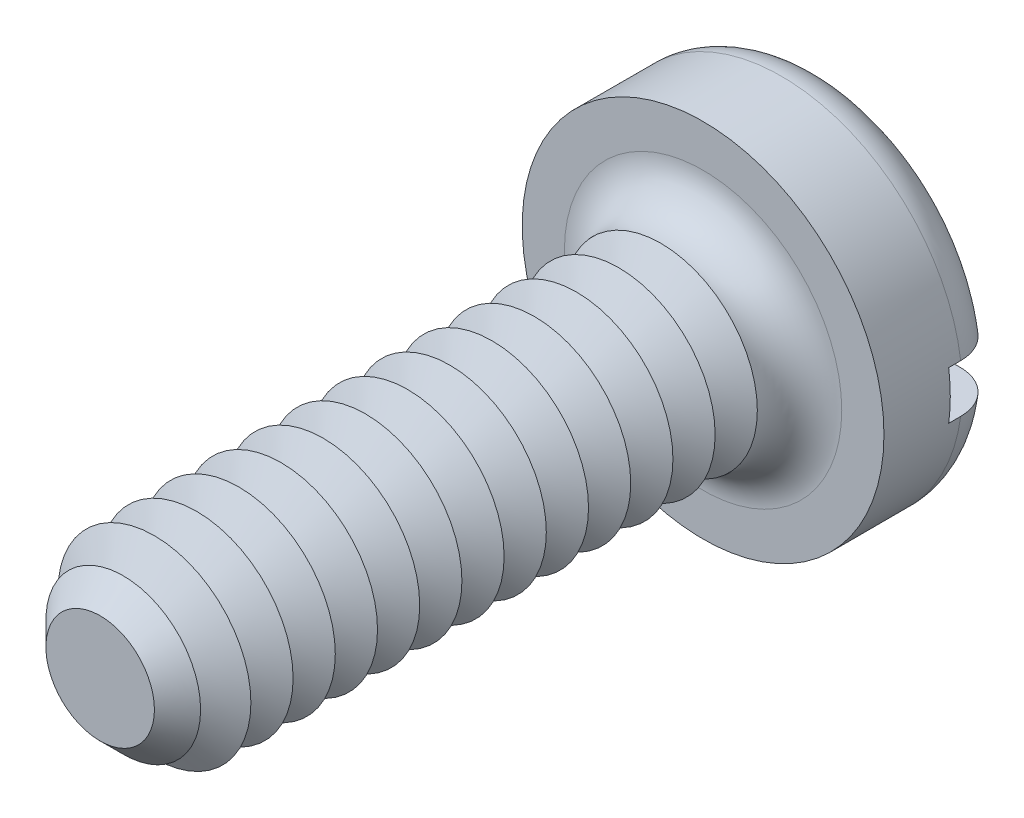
ISO-10303-21;
HEADER;
FILE_DESCRIPTION(('STEP AP214'),'2;1');
FILE_NAME('part.step','',(''),(''),'','','');
FILE_SCHEMA(('AUTOMOTIVE_DESIGN { 1 0 10303 214 1 1 1 1 }'));
ENDSEC;
DATA;
#1=APPLICATION_CONTEXT('core data for automotive mechanical design processes');
#2=APPLICATION_PROTOCOL_DEFINITION('international standard','automotive_design',2000,#1);
#3=PRODUCT_CONTEXT('',#1,'mechanical');
#4=PRODUCT('Part','Part','',(#3));
#5=PRODUCT_RELATED_PRODUCT_CATEGORY('part','',(#4));
#6=PRODUCT_DEFINITION_FORMATION('','',#4);
#7=PRODUCT_DEFINITION_CONTEXT('part definition',#1,'design');
#8=PRODUCT_DEFINITION('design','',#6,#7);
#9=PRODUCT_DEFINITION_SHAPE('','',#8);
#10=(LENGTH_UNIT() NAMED_UNIT(*) SI_UNIT(.MILLI.,.METRE.));
#11=(NAMED_UNIT(*) PLANE_ANGLE_UNIT() SI_UNIT($,.RADIAN.));
#12=(NAMED_UNIT(*) SI_UNIT($,.STERADIAN.) SOLID_ANGLE_UNIT());
#13=UNCERTAINTY_MEASURE_WITH_UNIT(LENGTH_MEASURE(1.E-05),#10,'distance_accuracy_value','');
#14=(GEOMETRIC_REPRESENTATION_CONTEXT(3) GLOBAL_UNCERTAINTY_ASSIGNED_CONTEXT((#13)) GLOBAL_UNIT_ASSIGNED_CONTEXT((#10,
#11,#12)) REPRESENTATION_CONTEXT('',''));
#15=CARTESIAN_POINT('',(0.,0.,0.));
#16=DIRECTION('',(0.,0.,1.));
#17=DIRECTION('',(1.,0.,0.));
#18=AXIS2_PLACEMENT_3D('',#15,#16,#17);
#19=CARTESIAN_POINT('',(0.,0.,-1.));
#20=DIRECTION('',(0.,0.,1.));
#21=DIRECTION('',(1.,0.,0.));
#22=AXIS2_PLACEMENT_3D('',#19,#20,#21);
#23=PLANE('',#22);
#24=CARTESIAN_POINT('',(0.,0.,-1.));
#25=DIRECTION('',(0.,0.,1.));
#26=DIRECTION('',(1.,0.,0.));
#27=AXIS2_PLACEMENT_3D('',#24,#25,#26);
#28=CIRCLE('',#27,1.15);
#29=CARTESIAN_POINT('',(-1.13247516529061,0.2,-1.));
#30=VERTEX_POINT('',#29);
#31=CARTESIAN_POINT('',(1.13247516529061,0.2,-1.));
#32=VERTEX_POINT('',#31);
#33=EDGE_CURVE('E116',#30,#32,#28,.F.);
#34=ORIENTED_EDGE('',*,*,#33,.T.);
#35=DIRECTION('',(1.,0.,0.));
#36=VECTOR('',#35,1.);
#37=CARTESIAN_POINT('',(-1.5,0.2,-1.));
#38=LINE('',#37,#36);
#39=EDGE_CURVE('E111',#30,#32,#38,.T.);
#40=ORIENTED_EDGE('',*,*,#39,.F.);
#41=EDGE_LOOP('',(#34,#40));
#42=FACE_BOUND('',#41,.T.);
#43=ADVANCED_FACE('F39',(#42),#23,.F.);
#44=CARTESIAN_POINT('',(0.,0.,-0.65));
#45=DIRECTION('',(0.,0.,1.));
#46=DIRECTION('',(1.,0.,0.));
#47=AXIS2_PLACEMENT_3D('',#44,#45,#46);
#48=TOROIDAL_SURFACE('',#47,1.15,0.35);
#49=CARTESIAN_POINT('',(-1.38697162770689,0.2,-0.89359719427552));
#50=CARTESIAN_POINT('',(-1.37305556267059,0.2,-0.907805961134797));
#51=CARTESIAN_POINT('',(-1.35791811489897,0.2,-0.9208403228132));
#52=CARTESIAN_POINT('',(-1.32565069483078,0.2,-0.944183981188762));
#53=CARTESIAN_POINT('',(-1.3085180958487,0.2,-0.954489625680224));
#54=CARTESIAN_POINT('',(-1.27278567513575,0.2,-0.972077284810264));
#55=CARTESIAN_POINT('',(-1.25418732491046,0.2,-0.979362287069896));
#56=CARTESIAN_POINT('',(-1.21604452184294,0.2,-0.990735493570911));
#57=CARTESIAN_POINT('',(-1.19650030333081,0.2,-0.994824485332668));
#58=CARTESIAN_POINT('',(-1.15682398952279,0.2,-0.99973845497));
#59=CARTESIAN_POINT('',(-1.1366881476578,0.2,-1.00053316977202));
#60=CARTESIAN_POINT('',(-1.09656272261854,0.2,-0.998770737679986));
#61=CARTESIAN_POINT('',(-1.07657315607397,0.2,-0.996213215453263));
#62=CARTESIAN_POINT('',(-1.03707277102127,0.2,-0.987780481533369));
#63=CARTESIAN_POINT('',(-1.01756977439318,0.2,-0.981868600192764));
#64=CARTESIAN_POINT('',(-0.979825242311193,0.2,-0.966867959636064));
#65=CARTESIAN_POINT('',(-0.961583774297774,0.2,-0.957779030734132));
#66=CARTESIAN_POINT('',(-0.926815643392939,0.2,-0.936628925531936));
#67=CARTESIAN_POINT('',(-0.910295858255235,0.2,-0.924556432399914));
#68=CARTESIAN_POINT('',(-0.879544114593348,0.2,-0.897781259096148));
#69=CARTESIAN_POINT('',(-0.8653120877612,0.2,-0.883078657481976));
#70=CARTESIAN_POINT('',(-0.83972745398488,0.2,-0.851619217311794));
#71=CARTESIAN_POINT('',(-0.8283448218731,0.2,-0.834886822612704));
#72=CARTESIAN_POINT('',(-0.80863848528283,0.2,-0.799707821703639));
#73=CARTESIAN_POINT('',(-0.80031425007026,0.2,-0.781261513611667));
#74=CARTESIAN_POINT('',(-0.787199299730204,0.2,-0.743695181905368));
#75=CARTESIAN_POINT('',(-0.782321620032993,0.2,-0.724605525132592));
#76=CARTESIAN_POINT('',(-0.775930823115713,0.2,-0.685871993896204));
#77=CARTESIAN_POINT('',(-0.774417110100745,0.2,-0.666228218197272));
#78=CARTESIAN_POINT('',(-0.774805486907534,0.2,-0.627456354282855));
#79=CARTESIAN_POINT('',(-0.776625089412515,0.2,-0.608327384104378));
#80=CARTESIAN_POINT('',(-0.783452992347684,0.2,-0.570648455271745));
#81=CARTESIAN_POINT('',(-0.788461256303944,0.2,-0.552098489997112));
#82=CARTESIAN_POINT('',(-0.801489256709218,0.2,-0.516098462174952));
#83=CARTESIAN_POINT('',(-0.809507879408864,0.2,-0.49864799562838));
#84=CARTESIAN_POINT('',(-0.828295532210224,0.2,-0.465297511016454));
#85=CARTESIAN_POINT('',(-0.839064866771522,0.2,-0.449397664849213));
#86=CARTESIAN_POINT('',(-0.863311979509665,0.2,-0.419196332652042));
#87=CARTESIAN_POINT('',(-0.876847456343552,0.2,-0.404941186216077));
#88=CARTESIAN_POINT('',(-0.906064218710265,0.2,-0.378832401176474));
#89=CARTESIAN_POINT('',(-0.921745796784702,0.2,-0.366979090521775));
#90=CARTESIAN_POINT('',(-0.955261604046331,0.2,-0.345690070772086));
#91=CARTESIAN_POINT('',(-0.973141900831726,0.2,-0.336326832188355));
#92=CARTESIAN_POINT('',(-1.01020647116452,0.2,-0.320690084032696));
#93=CARTESIAN_POINT('',(-1.02939085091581,0.2,-0.314416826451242));
#94=CARTESIAN_POINT('',(-1.06878849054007,0.2,-0.305073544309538));
#95=CARTESIAN_POINT('',(-1.0890118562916,0.2,-0.302046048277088));
#96=CARTESIAN_POINT('',(-1.12968032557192,0.2,-0.299436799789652));
#97=CARTESIAN_POINT('',(-1.15012542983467,0.2,-0.299855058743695));
#98=CARTESIAN_POINT('',(-1.1906059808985,0.2,-0.304138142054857));
#99=CARTESIAN_POINT('',(-1.21064224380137,0.2,-0.307995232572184));
#100=CARTESIAN_POINT('',(-1.24976957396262,0.2,-0.319055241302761));
#101=CARTESIAN_POINT('',(-1.26886068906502,0.2,-0.326257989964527));
#102=CARTESIAN_POINT('',(-1.30533597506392,0.2,-0.343725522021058));
#103=CARTESIAN_POINT('',(-1.32273620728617,0.2,-0.353956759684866));
#104=CARTESIAN_POINT('',(-1.35554323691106,0.2,-0.377229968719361));
#105=CARTESIAN_POINT('',(-1.37095016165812,0.2,-0.390271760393));
#106=CARTESIAN_POINT('',(-1.39913145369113,0.2,-0.418621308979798));
#107=CARTESIAN_POINT('',(-1.41193602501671,0.2,-0.43389904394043));
#108=CARTESIAN_POINT('',(-1.43476712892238,0.2,-0.46640589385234));
#109=CARTESIAN_POINT('',(-1.44479381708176,0.2,-0.483634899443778));
#110=CARTESIAN_POINT('',(-1.4616814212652,0.2,-0.519367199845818));
#111=CARTESIAN_POINT('',(-1.46857323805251,0.2,-0.537855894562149));
#112=CARTESIAN_POINT('',(-1.4791331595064,0.2,-0.575731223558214));
#113=CARTESIAN_POINT('',(-1.48280152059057,0.2,-0.595117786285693));
#114=CARTESIAN_POINT('',(-1.4867930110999,0.2,-0.634109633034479));
#115=CARTESIAN_POINT('',(-1.48713684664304,0.2,-0.653712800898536));
#116=CARTESIAN_POINT('',(-1.48452244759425,0.2,-0.692702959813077));
#117=CARTESIAN_POINT('',(-1.48156342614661,0.2,-0.712089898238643));
#118=CARTESIAN_POINT('',(-1.47243636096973,0.2,-0.75006822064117));
#119=CARTESIAN_POINT('',(-1.46627182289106,0.2,-0.768660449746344));
#120=CARTESIAN_POINT('',(-1.45092056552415,0.2,-0.804533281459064));
#121=CARTESIAN_POINT('',(-1.44173755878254,0.2,-0.821815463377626));
#122=CARTESIAN_POINT('',(-1.42477940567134,0.2,-0.848152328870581));
#123=CARTESIAN_POINT('',(-1.41786672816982,0.2,-0.857773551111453));
#124=CARTESIAN_POINT('',(-1.40310412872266,0.2,-0.876267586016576));
#125=CARTESIAN_POINT('',(-1.39525421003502,0.2,-0.885140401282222));
#126=CARTESIAN_POINT('',(-1.38697162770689,0.2,-0.89359719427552));
#127=B_SPLINE_CURVE_WITH_KNOTS('',3,(#49,#50,#51,#52,#53,#54,#55,#56,#57,#58,#59,#60,#61,#62,
#63,#64,#65,#66,#67,#68,#69,#70,#71,#72,#73,#74,#75,#76,#77,#78,#79,#80,#81,#82,#83,#84,#85,#86,
#87,#88,#89,#90,#91,#92,#93,#94,#95,#96,#97,#98,#99,#100,#101,#102,#103,#104,#105,#106,#107,
#108,#109,#110,#111,#112,#113,#114,#115,#116,#117,#118,#119,#120,#121,#122,#123,#124,#125,#126),
.UNSPECIFIED.,.T.,.F.,(4,2,2,2,2,2,2,2,2,2,2,2,2,2,2,2,2,2,2,2,2,2,2,2,2,2,2,2,2,2,2,2,2,2,2,2,
2,2,4),(0.,0.0596211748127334,0.119321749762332,0.178963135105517,0.238589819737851,
0.298763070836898,0.358943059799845,0.419793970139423,0.48064813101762,0.541736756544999,
0.602823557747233,0.663236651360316,0.72363925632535,0.782457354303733,0.841265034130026,
0.898637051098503,0.956008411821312,1.01335856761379,1.07071507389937,1.12941939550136,
1.18813172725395,1.24840147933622,1.30867614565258,1.36973127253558,1.43078660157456,
1.49170496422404,1.55262023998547,1.61288453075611,1.67314496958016,1.73266007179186,
1.792171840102,1.85108355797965,1.90999058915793,1.96853049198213,2.02708434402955,
2.08557429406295,2.14399257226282,2.17947810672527,2.21496351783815),.UNSPECIFIED.);
#128=CARTESIAN_POINT('',(-1.48660687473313,0.2,-0.649999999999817));
#129=VERTEX_POINT('',#128);
#130=EDGE_CURVE('E289',#129,#30,#127,.T.);
#131=ORIENTED_EDGE('',*,*,#130,.F.);
#132=CARTESIAN_POINT('',(0.,0.,-0.65));
#133=DIRECTION('',(0.,0.,1.));
#134=DIRECTION('',(1.,0.,0.));
#135=AXIS2_PLACEMENT_3D('',#132,#133,#134);
#136=CIRCLE('',#135,1.5);
#137=CARTESIAN_POINT('',(1.48660687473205,0.2,-0.649999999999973));
#138=VERTEX_POINT('',#137);
#139=EDGE_CURVE('E125',#138,#129,#136,.T.);
#140=ORIENTED_EDGE('',*,*,#139,.F.);
#141=CARTESIAN_POINT('',(0.780520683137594,0.2,-0.713112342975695));
#142=CARTESIAN_POINT('',(0.784146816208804,0.2,-0.73226748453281));
#143=CARTESIAN_POINT('',(0.789425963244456,0.2,-0.751125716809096));
#144=CARTESIAN_POINT('',(0.803106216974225,0.2,-0.78769198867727));
#145=CARTESIAN_POINT('',(0.811511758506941,0.2,-0.805398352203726));
#146=CARTESIAN_POINT('',(0.831144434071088,0.2,-0.839131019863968));
#147=CARTESIAN_POINT('',(0.842366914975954,0.2,-0.855160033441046));
#148=CARTESIAN_POINT('',(0.867288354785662,0.2,-0.88515062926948));
#149=CARTESIAN_POINT('',(0.880986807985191,0.2,-0.899112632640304));
#150=CARTESIAN_POINT('',(0.910770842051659,0.2,-0.924888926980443));
#151=CARTESIAN_POINT('',(0.926899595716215,0.2,-0.936653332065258));
#152=CARTESIAN_POINT('',(0.960871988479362,0.2,-0.957372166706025));
#153=CARTESIAN_POINT('',(0.978715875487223,0.2,-0.966326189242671));
#154=CARTESIAN_POINT('',(1.01600338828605,0.2,-0.981340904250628));
#155=CARTESIAN_POINT('',(1.03547204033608,0.2,-0.987339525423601));
#156=CARTESIAN_POINT('',(1.07513874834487,0.2,-0.995998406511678));
#157=CARTESIAN_POINT('',(1.09533683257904,0.2,-0.998658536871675));
#158=CARTESIAN_POINT('',(1.1359751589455,0.2,-1.0005575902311));
#159=CARTESIAN_POINT('',(1.1564160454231,0.2,-0.99978283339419));
#160=CARTESIAN_POINT('',(1.19687229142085,0.2,-0.994784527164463));
#161=CARTESIAN_POINT('',(1.21688766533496,0.2,-0.990561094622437));
#162=CARTESIAN_POINT('',(1.25575385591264,0.2,-0.978813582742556));
#163=CARTESIAN_POINT('',(1.27461259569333,0.2,-0.971315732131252));
#164=CARTESIAN_POINT('',(1.31078063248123,0.2,-0.953221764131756));
#165=CARTESIAN_POINT('',(1.32809002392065,0.2,-0.942625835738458));
#166=CARTESIAN_POINT('',(1.36044102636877,0.2,-0.918776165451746));
#167=CARTESIAN_POINT('',(1.37550786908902,0.2,-0.905556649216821));
#168=CARTESIAN_POINT('',(1.40317627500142,0.2,-0.876749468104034));
#169=CARTESIAN_POINT('',(1.41577799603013,0.2,-0.861161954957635));
#170=CARTESIAN_POINT('',(1.43800830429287,0.2,-0.828254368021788));
#171=CARTESIAN_POINT('',(1.44766923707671,0.2,-0.810956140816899));
#172=CARTESIAN_POINT('',(1.46392269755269,0.2,-0.774973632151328));
#173=CARTESIAN_POINT('',(1.4705153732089,0.2,-0.756289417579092));
#174=CARTESIAN_POINT('',(1.48039453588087,0.2,-0.718226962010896));
#175=CARTESIAN_POINT('',(1.48370713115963,0.2,-0.69885549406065));
#176=CARTESIAN_POINT('',(1.48701993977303,0.2,-0.659831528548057));
#177=CARTESIAN_POINT('',(1.4870202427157,0.2,-0.640179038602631));
#178=CARTESIAN_POINT('',(1.48371470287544,0.2,-0.6012267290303));
#179=CARTESIAN_POINT('',(1.48042091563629,0.2,-0.581925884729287));
#180=CARTESIAN_POINT('',(1.47064268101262,0.2,-0.544150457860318));
#181=CARTESIAN_POINT('',(1.46415824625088,0.2,-0.525675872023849));
#182=CARTESIAN_POINT('',(1.4481813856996,0.2,-0.490055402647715));
#183=CARTESIAN_POINT('',(1.43868601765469,0.2,-0.472910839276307));
#184=CARTESIAN_POINT('',(1.41696658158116,0.2,-0.440447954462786));
#185=CARTESIAN_POINT('',(1.40474246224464,0.2,-0.425129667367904));
#186=CARTESIAN_POINT('',(1.37784446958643,0.2,-0.39666049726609));
#187=CARTESIAN_POINT('',(1.36315749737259,0.2,-0.383521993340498));
#188=CARTESIAN_POINT('',(1.33180407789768,0.2,-0.359869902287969));
#189=CARTESIAN_POINT('',(1.31513754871,0.2,-0.349356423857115));
#190=CARTESIAN_POINT('',(1.28013085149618,0.2,-0.331143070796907));
#191=CARTESIAN_POINT('',(1.26177629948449,0.2,-0.323470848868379));
#192=CARTESIAN_POINT('',(1.224049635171,0.2,-0.311275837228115));
#193=CARTESIAN_POINT('',(1.20467746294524,0.2,-0.306753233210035));
#194=CARTESIAN_POINT('',(1.1652160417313,0.2,-0.300927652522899));
#195=CARTESIAN_POINT('',(1.14512096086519,0.2,-0.299664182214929));
#196=CARTESIAN_POINT('',(1.10499953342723,0.2,-0.300488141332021));
#197=CARTESIAN_POINT('',(1.08497319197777,0.2,-0.302575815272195));
#198=CARTESIAN_POINT('',(1.04531606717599,0.2,-0.310075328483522));
#199=CARTESIAN_POINT('',(1.0256923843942,0.2,-0.315524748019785));
#200=CARTESIAN_POINT('',(0.987629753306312,0.2,-0.329624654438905));
#201=CARTESIAN_POINT('',(0.96919087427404,0.2,-0.338275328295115));
#202=CARTESIAN_POINT('',(0.933939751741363,0.2,-0.358590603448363));
#203=CARTESIAN_POINT('',(0.917135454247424,0.2,-0.370269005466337));
#204=CARTESIAN_POINT('',(0.88574931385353,0.2,-0.396306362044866));
#205=CARTESIAN_POINT('',(0.87116734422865,0.2,-0.410665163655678));
#206=CARTESIAN_POINT('',(0.844813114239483,0.2,-0.441518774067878));
#207=CARTESIAN_POINT('',(0.833014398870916,0.2,-0.457990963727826));
#208=CARTESIAN_POINT('',(0.812431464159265,0.2,-0.492729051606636));
#209=CARTESIAN_POINT('',(0.803647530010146,0.2,-0.510995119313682));
#210=CARTESIAN_POINT('',(0.789590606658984,0.2,-0.548308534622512));
#211=CARTESIAN_POINT('',(0.784235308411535,0.2,-0.5673249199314));
#212=CARTESIAN_POINT('',(0.7768953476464,0.2,-0.605979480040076));
#213=CARTESIAN_POINT('',(0.774905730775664,0.2,-0.625616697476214));
#214=CARTESIAN_POINT('',(0.774470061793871,0.2,-0.656633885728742));
#215=CARTESIAN_POINT('',(0.7748847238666,0.2,-0.668009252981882));
#216=CARTESIAN_POINT('',(0.776852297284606,0.2,-0.690660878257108));
#217=CARTESIAN_POINT('',(0.77840517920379,0.2,-0.701937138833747));
#218=CARTESIAN_POINT('',(0.780520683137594,0.2,-0.713112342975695));
#219=B_SPLINE_CURVE_WITH_KNOTS('',3,(#141,#142,#143,#144,#145,#146,#147,#148,#149,#150,#151,
#152,#153,#154,#155,#156,#157,#158,#159,#160,#161,#162,#163,#164,#165,#166,#167,#168,#169,#170,
#171,#172,#173,#174,#175,#176,#177,#178,#179,#180,#181,#182,#183,#184,#185,#186,#187,#188,#189,
#190,#191,#192,#193,#194,#195,#196,#197,#198,#199,#200,#201,#202,#203,#204,#205,#206,#207,#208,
#209,#210,#211,#212,#213,#214,#215,#216,#217,#218),.UNSPECIFIED.,.T.,.F.,(4,2,2,2,2,2,2,2,2,2,2,
2,2,2,2,2,2,2,2,2,2,2,2,2,2,2,2,2,2,2,2,2,2,2,2,2,2,2,4),(0.,0.0584431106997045,
0.11696944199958,0.175399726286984,0.233818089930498,0.293433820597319,0.353058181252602,
0.413886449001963,0.474717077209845,0.53579018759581,0.596861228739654,0.65745180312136,
0.718038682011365,0.777881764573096,0.837721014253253,0.896876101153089,0.95602833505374,
1.01470585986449,1.07338179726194,1.13184377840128,1.19030552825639,1.24882458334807,
1.30734473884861,1.36618662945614,1.42503095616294,1.48443380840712,1.54384016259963,
1.60396331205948,1.66409084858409,1.72490303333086,1.78571877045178,1.84681674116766,
1.90791122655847,1.96839922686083,2.02889294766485,2.08787382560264,2.14676780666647,
2.18086468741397,2.21496068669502),.UNSPECIFIED.);
#220=EDGE_CURVE('E291',#32,#138,#219,.T.);
#221=ORIENTED_EDGE('',*,*,#220,.F.);
#222=ORIENTED_EDGE('',*,*,#33,.F.);
#223=EDGE_LOOP('',(#131,#140,#221,#222));
#224=FACE_BOUND('',#223,.T.);
#225=ADVANCED_FACE('F273',(#224),#48,.T.);
#226=CARTESIAN_POINT('',(0.,0.,-1.));
#227=DIRECTION('',(0.,0.,1.));
#228=DIRECTION('',(1.,0.,0.));
#229=AXIS2_PLACEMENT_3D('',#226,#227,#228);
#230=CYLINDRICAL_SURFACE('',#229,1.5);
#231=DIRECTION('',(0.,0.,1.));
#232=VECTOR('',#231,1.);
#233=CARTESIAN_POINT('',(1.48660687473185,0.2,-1.));
#234=LINE('',#233,#232);
#235=CARTESIAN_POINT('',(1.48660687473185,0.2,-0.55));
#236=VERTEX_POINT('',#235);
#237=EDGE_CURVE('E306',#138,#236,#234,.T.);
#238=ORIENTED_EDGE('',*,*,#237,.F.);
#239=ORIENTED_EDGE('',*,*,#139,.T.);
#240=DIRECTION('',(0.,0.,1.));
#241=VECTOR('',#240,1.);
#242=CARTESIAN_POINT('',(-1.48660687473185,0.2,-1.));
#243=LINE('',#242,#241);
#244=CARTESIAN_POINT('',(-1.48660687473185,0.2,-0.55));
#245=VERTEX_POINT('',#244);
#246=EDGE_CURVE('E63',#245,#129,#243,.F.);
#247=ORIENTED_EDGE('',*,*,#246,.F.);
#248=CARTESIAN_POINT('',(0.,0.,-0.55));
#249=DIRECTION('',(0.,0.,-1.));
#250=DIRECTION('',(-1.,0.,0.));
#251=AXIS2_PLACEMENT_3D('',#248,#249,#250);
#252=CIRCLE('',#251,1.5);
#253=CARTESIAN_POINT('',(-1.48660687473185,-0.2,-0.55));
#254=VERTEX_POINT('',#253);
#255=EDGE_CURVE('E43',#245,#254,#252,.F.);
#256=ORIENTED_EDGE('',*,*,#255,.T.);
#257=DIRECTION('',(0.,0.,1.));
#258=VECTOR('',#257,1.);
#259=CARTESIAN_POINT('',(-1.48660687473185,-0.2,-1.));
#260=LINE('',#259,#258);
#261=CARTESIAN_POINT('',(-1.48660687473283,-0.2,-0.650000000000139));
#262=VERTEX_POINT('',#261);
#263=EDGE_CURVE('E303',#262,#254,#260,.T.);
#264=ORIENTED_EDGE('',*,*,#263,.F.);
#265=CARTESIAN_POINT('',(1.48660687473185,-0.2,-0.65));
#266=VERTEX_POINT('',#265);
#267=EDGE_CURVE('E127',#262,#266,#136,.T.);
#268=ORIENTED_EDGE('',*,*,#267,.T.);
#269=DIRECTION('',(0.,0.,1.));
#270=VECTOR('',#269,1.);
#271=CARTESIAN_POINT('',(1.48660687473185,-0.2,-1.));
#272=LINE('',#271,#270);
#273=CARTESIAN_POINT('',(1.48660687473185,-0.2,-0.55));
#274=VERTEX_POINT('',#273);
#275=EDGE_CURVE('E55',#274,#266,#272,.F.);
#276=ORIENTED_EDGE('',*,*,#275,.F.);
#277=EDGE_CURVE('E11',#274,#236,#252,.F.);
#278=ORIENTED_EDGE('',*,*,#277,.T.);
#279=EDGE_LOOP('',(#238,#239,#247,#256,#264,#268,#276,#278));
#280=FACE_BOUND('',#279,.T.);
#281=CARTESIAN_POINT('',(0.,0.,0.));
#282=DIRECTION('',(0.,0.,1.));
#283=DIRECTION('',(1.,0.,0.));
#284=AXIS2_PLACEMENT_3D('',#281,#282,#283);
#285=CIRCLE('',#284,1.5);
#286=CARTESIAN_POINT('',(1.5,0.,0.));
#287=VERTEX_POINT('',#286);
#288=EDGE_CURVE('E309',#287,#287,#285,.T.);
#289=ORIENTED_EDGE('',*,*,#288,.F.);
#290=EDGE_LOOP('',(#289));
#291=FACE_BOUND('',#290,.T.);
#292=ADVANCED_FACE('F269',(#280,#291),#230,.T.);
#293=CARTESIAN_POINT('',(1.13247516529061,-0.2,-1.));
#294=VERTEX_POINT('',#293);
#295=CARTESIAN_POINT('',(-1.13247516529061,-0.2,-1.));
#296=VERTEX_POINT('',#295);
#297=EDGE_CURVE('E109',#294,#296,#28,.F.);
#298=ORIENTED_EDGE('',*,*,#297,.T.);
#299=DIRECTION('',(-1.,0.,0.));
#300=VECTOR('',#299,1.);
#301=CARTESIAN_POINT('',(-1.5,-0.2,-1.));
#302=LINE('',#301,#300);
#303=EDGE_CURVE('E96',#294,#296,#302,.T.);
#304=ORIENTED_EDGE('',*,*,#303,.F.);
#305=EDGE_LOOP('',(#298,#304));
#306=FACE_BOUND('',#305,.T.);
#307=ADVANCED_FACE('F108',(#306),#23,.F.);
#308=CARTESIAN_POINT('',(0.,0.,0.));
#309=DIRECTION('',(0.,0.,1.));
#310=DIRECTION('',(1.,0.,0.));
#311=AXIS2_PLACEMENT_3D('',#308,#309,#310);
#312=PLANE('',#311);
#313=CARTESIAN_POINT('',(0.,0.,0.));
#314=DIRECTION('',(0.,0.,1.));
#315=DIRECTION('',(1.,0.,0.));
#316=AXIS2_PLACEMENT_3D('',#313,#314,#315);
#317=CIRCLE('',#316,1.15);
#318=CARTESIAN_POINT('',(1.15,0.,0.));
#319=VERTEX_POINT('',#318);
#320=EDGE_CURVE('E115',#319,#319,#317,.F.);
#321=ORIENTED_EDGE('',*,*,#320,.T.);
#322=EDGE_LOOP('',(#321));
#323=FACE_BOUND('',#322,.T.);
#324=ORIENTED_EDGE('',*,*,#288,.T.);
#325=EDGE_LOOP('',(#324));
#326=FACE_BOUND('',#325,.T.);
#327=ADVANCED_FACE('F268',(#323,#326),#312,.T.);
#328=CARTESIAN_POINT('',(-1.38697162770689,-0.2,-0.89359719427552));
#329=CARTESIAN_POINT('',(-1.40068341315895,-0.2,-0.87959447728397));
#330=CARTESIAN_POINT('',(-1.41322919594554,-0.2,-0.864431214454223));
#331=CARTESIAN_POINT('',(-1.43561095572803,-0.2,-0.83220389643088));
#332=CARTESIAN_POINT('',(-1.44544396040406,-0.2,-0.815137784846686));
#333=CARTESIAN_POINT('',(-1.46209732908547,-0.2,-0.779595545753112));
#334=CARTESIAN_POINT('',(-1.46891825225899,-0.2,-0.761119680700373));
#335=CARTESIAN_POINT('',(-1.479344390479,-0.2,-0.723286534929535));
#336=CARTESIAN_POINT('',(-1.48295036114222,-0.2,-0.703929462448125));
#337=CARTESIAN_POINT('',(-1.48683413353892,-0.2,-0.6649653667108));
#338=CARTESIAN_POINT('',(-1.48712565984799,-0.2,-0.645359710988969));
#339=CARTESIAN_POINT('',(-1.48440736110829,-0.2,-0.606378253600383));
#340=CARTESIAN_POINT('',(-1.48139747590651,-0.2,-0.587002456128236));
#341=CARTESIAN_POINT('',(-1.47217267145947,-0.2,-0.549061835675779));
#342=CARTESIAN_POINT('',(-1.46596274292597,-0.2,-0.530495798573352));
#343=CARTESIAN_POINT('',(-1.45052327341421,-0.2,-0.494665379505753));
#344=CARTESIAN_POINT('',(-1.44129371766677,-0.2,-0.477401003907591));
#345=CARTESIAN_POINT('',(-1.42005139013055,-0.2,-0.444603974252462));
#346=CARTESIAN_POINT('',(-1.40803014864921,-0.2,-0.429076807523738));
#347=CARTESIAN_POINT('',(-1.38156905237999,-0.2,-0.400242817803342));
#348=CARTESIAN_POINT('',(-1.36712913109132,-0.2,-0.386936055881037));
#349=CARTESIAN_POINT('',(-1.33612890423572,-0.2,-0.362811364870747));
#350=CARTESIAN_POINT('',(-1.31955365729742,-0.2,-0.352012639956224));
#351=CARTESIAN_POINT('',(-1.28484098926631,-0.2,-0.333316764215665));
#352=CARTESIAN_POINT('',(-1.26670348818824,-0.2,-0.325419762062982));
#353=CARTESIAN_POINT('',(-1.22917040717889,-0.2,-0.31265726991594));
#354=CARTESIAN_POINT('',(-1.20976324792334,-0.2,-0.3078258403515));
#355=CARTESIAN_POINT('',(-1.17041685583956,-0.2,-0.30144641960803));
#356=CARTESIAN_POINT('',(-1.15047758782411,-0.2,-0.299898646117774));
#357=CARTESIAN_POINT('',(-1.11037109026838,-0.2,-0.300112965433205));
#358=CARTESIAN_POINT('',(-1.09020407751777,-0.2,-0.301916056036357));
#359=CARTESIAN_POINT('',(-1.05044996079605,-0.2,-0.308849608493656));
#360=CARTESIAN_POINT('',(-1.03086289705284,-0.2,-0.313980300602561));
#361=CARTESIAN_POINT('',(-0.992636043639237,-0.2,-0.327485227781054));
#362=CARTESIAN_POINT('',(-0.974006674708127,-0.2,-0.335888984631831));
#363=CARTESIAN_POINT('',(-0.938423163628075,-0.2,-0.355707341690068));
#364=CARTESIAN_POINT('',(-0.921469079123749,-0.2,-0.367122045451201));
#365=CARTESIAN_POINT('',(-0.889752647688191,-0.2,-0.392642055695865));
#366=CARTESIAN_POINT('',(-0.874987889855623,-0.2,-0.406744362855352));
#367=CARTESIAN_POINT('',(-0.848085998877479,-0.2,-0.437266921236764));
#368=CARTESIAN_POINT('',(-0.835948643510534,-0.2,-0.453686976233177));
#369=CARTESIAN_POINT('',(-0.814894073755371,-0.2,-0.488078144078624));
#370=CARTESIAN_POINT('',(-0.805923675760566,-0.2,-0.506016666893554));
#371=CARTESIAN_POINT('',(-0.791223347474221,-0.2,-0.543175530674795));
#372=CARTESIAN_POINT('',(-0.78549275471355,-0.2,-0.562395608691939));
#373=CARTESIAN_POINT('',(-0.777599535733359,-0.2,-0.600984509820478));
#374=CARTESIAN_POINT('',(-0.775340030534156,-0.2,-0.62033354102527));
#375=CARTESIAN_POINT('',(-0.774164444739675,-0.2,-0.659131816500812));
#376=CARTESIAN_POINT('',(-0.775247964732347,-0.2,-0.678581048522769));
#377=CARTESIAN_POINT('',(-0.78067015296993,-0.2,-0.716679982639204));
#378=CARTESIAN_POINT('',(-0.784953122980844,-0.2,-0.735337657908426));
#379=CARTESIAN_POINT('',(-0.796558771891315,-0.2,-0.771681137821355));
#380=CARTESIAN_POINT('',(-0.803881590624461,-0.2,-0.789366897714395));
#381=CARTESIAN_POINT('',(-0.821417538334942,-0.2,-0.823475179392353));
#382=CARTESIAN_POINT('',(-0.831660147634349,-0.2,-0.839882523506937));
#383=CARTESIAN_POINT('',(-0.854684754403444,-0.2,-0.870805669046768));
#384=CARTESIAN_POINT('',(-0.867467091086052,-0.2,-0.885321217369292));
#385=CARTESIAN_POINT('',(-0.895584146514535,-0.2,-0.912470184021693));
#386=CARTESIAN_POINT('',(-0.910979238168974,-0.2,-0.925041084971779));
#387=CARTESIAN_POINT('',(-0.943622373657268,-0.2,-0.947488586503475));
#388=CARTESIAN_POINT('',(-0.960870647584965,-0.2,-0.957364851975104));
#389=CARTESIAN_POINT('',(-0.997151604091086,-0.2,-0.974359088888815));
#390=CARTESIAN_POINT('',(-1.01621564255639,-0.2,-0.98141019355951));
#391=CARTESIAN_POINT('',(-1.05525219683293,-0.2,-0.992235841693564));
#392=CARTESIAN_POINT('',(-1.07522472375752,-0.2,-0.996010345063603));
#393=CARTESIAN_POINT('',(-1.11565152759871,-0.2,-1.00018247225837));
#394=CARTESIAN_POINT('',(-1.1361080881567,-0.2,-1.00055804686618));
#395=CARTESIAN_POINT('',(-1.17679659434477,-0.2,-0.997846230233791));
#396=CARTESIAN_POINT('',(-1.19702848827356,-0.2,-0.994758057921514));
#397=CARTESIAN_POINT('',(-1.23655375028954,-0.2,-0.985216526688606));
#398=CARTESIAN_POINT('',(-1.25585198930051,-0.2,-0.978783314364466));
#399=CARTESIAN_POINT('',(-1.29305658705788,-0.2,-0.962732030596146));
#400=CARTESIAN_POINT('',(-1.31096467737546,-0.2,-0.953118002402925));
#401=CARTESIAN_POINT('',(-1.33859353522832,-0.2,-0.935076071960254));
#402=CARTESIAN_POINT('',(-1.34889525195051,-0.2,-0.927521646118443));
#403=CARTESIAN_POINT('',(-1.36861998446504,-0.2,-0.911341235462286));
#404=CARTESIAN_POINT('',(-1.37804300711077,-0.2,-0.90271525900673));
#405=CARTESIAN_POINT('',(-1.38697162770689,-0.2,-0.89359719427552));
#406=B_SPLINE_CURVE_WITH_KNOTS('',3,(#328,#329,#330,#331,#332,#333,#334,#335,#336,#337,#338,
#339,#340,#341,#342,#343,#344,#345,#346,#347,#348,#349,#350,#351,#352,#353,#354,#355,#356,#357,
#358,#359,#360,#361,#362,#363,#364,#365,#366,#367,#368,#369,#370,#371,#372,#373,#374,#375,#376,
#377,#378,#379,#380,#381,#382,#383,#384,#385,#386,#387,#388,#389,#390,#391,#392,#393,#394,#395,
#396,#397,#398,#399,#400,#401,#402,#403,#404,#405),.UNSPECIFIED.,.T.,.F.,(4,2,2,2,2,2,2,2,2,2,2,
2,2,2,2,2,2,2,2,2,2,2,2,2,2,2,2,2,2,2,2,2,2,2,2,2,2,2,4),(0.,0.0587484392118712,
0.117560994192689,0.17636262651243,0.235150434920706,0.293694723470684,0.352240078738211,
0.410694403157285,0.46914901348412,0.527783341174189,0.586419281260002,0.645490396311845,
0.704564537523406,0.76428403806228,0.824007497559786,0.884466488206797,0.944929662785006,
1.00595131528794,1.06697506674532,1.12793111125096,1.18888199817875,1.2487542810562,
1.30861431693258,1.36677117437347,1.4249210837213,1.48208160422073,1.53924475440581,
1.59700685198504,1.65477666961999,1.71413044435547,1.77349159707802,1.83418476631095,
1.89487867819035,1.95596603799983,2.01706717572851,2.07780450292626,2.13846491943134,
2.17672008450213,2.21497495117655),.UNSPECIFIED.);
#407=EDGE_CURVE('E103',#296,#262,#406,.T.);
#408=ORIENTED_EDGE('',*,*,#407,.F.);
#409=ORIENTED_EDGE('',*,*,#297,.F.);
#410=CARTESIAN_POINT('',(0.780520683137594,-0.2,-0.713112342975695));
#411=CARTESIAN_POINT('',(0.776967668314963,-0.2,-0.694332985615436));
#412=CARTESIAN_POINT('',(0.774997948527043,-0.2,-0.675240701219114));
#413=CARTESIAN_POINT('',(0.774305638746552,-0.2,-0.636983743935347));
#414=CARTESIAN_POINT('',(0.775586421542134,-0.2,-0.617819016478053));
#415=CARTESIAN_POINT('',(0.781350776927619,-0.2,-0.579992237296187));
#416=CARTESIAN_POINT('',(0.78583187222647,-0.2,-0.56132980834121));
#417=CARTESIAN_POINT('',(0.797836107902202,-0.2,-0.525016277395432));
#418=CARTESIAN_POINT('',(0.805358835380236,-0.2,-0.507365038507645));
#419=CARTESIAN_POINT('',(0.823276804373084,-0.2,-0.47338978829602));
#420=CARTESIAN_POINT('',(0.833696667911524,-0.2,-0.457078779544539));
#421=CARTESIAN_POINT('',(0.857057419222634,-0.2,-0.426375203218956));
#422=CARTESIAN_POINT('',(0.869998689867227,-0.2,-0.411982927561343));
#423=CARTESIAN_POINT('',(0.898418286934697,-0.2,-0.38510575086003));
#424=CARTESIAN_POINT('',(0.913956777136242,-0.2,-0.372684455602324));
#425=CARTESIAN_POINT('',(0.946860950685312,-0.2,-0.350558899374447));
#426=CARTESIAN_POINT('',(0.964226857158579,-0.2,-0.340854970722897));
#427=CARTESIAN_POINT('',(1.00070854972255,-0.2,-0.324232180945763));
#428=CARTESIAN_POINT('',(1.01985442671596,-0.2,-0.317379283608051));
#429=CARTESIAN_POINT('',(1.0590214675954,-0.2,-0.306962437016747));
#430=CARTESIAN_POINT('',(1.07904267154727,-0.2,-0.303398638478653));
#431=CARTESIAN_POINT('',(1.11952320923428,-0.2,-0.299657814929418));
#432=CARTESIAN_POINT('',(1.13998446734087,-0.2,-0.299501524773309));
#433=CARTESIAN_POINT('',(1.1806395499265,-0.2,-0.302650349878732));
#434=CARTESIAN_POINT('',(1.20083338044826,-0.2,-0.305955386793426));
#435=CARTESIAN_POINT('',(1.24023260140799,-0.2,-0.315918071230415));
#436=CARTESIAN_POINT('',(1.25944372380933,-0.2,-0.322553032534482));
#437=CARTESIAN_POINT('',(1.29645854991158,-0.2,-0.338992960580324));
#438=CARTESIAN_POINT('',(1.31426233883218,-0.2,-0.348797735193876));
#439=CARTESIAN_POINT('',(1.34772734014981,-0.2,-0.371172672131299));
#440=CARTESIAN_POINT('',(1.36341179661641,-0.2,-0.383708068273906));
#441=CARTESIAN_POINT('',(1.39242189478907,-0.2,-0.41126267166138));
#442=CARTESIAN_POINT('',(1.40574768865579,-0.2,-0.426281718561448));
#443=CARTESIAN_POINT('',(1.42949833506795,-0.2,-0.458186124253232));
#444=CARTESIAN_POINT('',(1.43995542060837,-0.2,-0.475047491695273));
#445=CARTESIAN_POINT('',(1.45786189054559,-0.2,-0.510298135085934));
#446=CARTESIAN_POINT('',(1.46531142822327,-0.2,-0.528687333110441));
#447=CARTESIAN_POINT('',(1.47692889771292,-0.2,-0.566301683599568));
#448=CARTESIAN_POINT('',(1.48112438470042,-0.2,-0.585518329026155));
#449=CARTESIAN_POINT('',(1.48621428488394,-0.2,-0.624383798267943));
#450=CARTESIAN_POINT('',(1.48710879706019,-0.2,-0.644032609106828));
#451=CARTESIAN_POINT('',(1.48557356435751,-0.2,-0.683115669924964));
#452=CARTESIAN_POINT('',(1.48315796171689,-0.2,-0.702550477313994));
#453=CARTESIAN_POINT('',(1.47509909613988,-0.2,-0.740738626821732));
#454=CARTESIAN_POINT('',(1.46945585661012,-0.2,-0.759491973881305));
#455=CARTESIAN_POINT('',(1.45510530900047,-0.2,-0.79579446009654));
#456=CARTESIAN_POINT('',(1.44639690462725,-0.2,-0.813343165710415));
#457=CARTESIAN_POINT('',(1.42617120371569,-0.2,-0.846738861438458));
#458=CARTESIAN_POINT('',(1.41465386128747,-0.2,-0.862585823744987));
#459=CARTESIAN_POINT('',(1.3890808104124,-0.2,-0.892214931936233));
#460=CARTESIAN_POINT('',(1.37501291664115,-0.2,-0.90598655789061));
#461=CARTESIAN_POINT('',(1.34478283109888,-0.2,-0.930997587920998));
#462=CARTESIAN_POINT('',(1.32862056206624,-0.2,-0.942236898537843));
#463=CARTESIAN_POINT('',(1.29450693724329,-0.2,-0.96197581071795));
#464=CARTESIAN_POINT('',(1.27654077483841,-0.2,-0.970449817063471));
#465=CARTESIAN_POINT('',(1.23945233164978,-0.2,-0.984300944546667));
#466=CARTESIAN_POINT('',(1.2203299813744,-0.2,-0.989677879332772));
#467=CARTESIAN_POINT('',(1.18123021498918,-0.2,-0.997250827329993));
#468=CARTESIAN_POINT('',(1.16124534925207,-0.2,-0.999408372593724));
#469=CARTESIAN_POINT('',(1.12119456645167,-0.2,-1.00037966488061));
#470=CARTESIAN_POINT('',(1.10112864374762,-0.2,-0.999193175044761));
#471=CARTESIAN_POINT('',(1.06123417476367,-0.2,-0.993489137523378));
#472=CARTESIAN_POINT('',(1.0414112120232,-0.2,-0.988932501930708));
#473=CARTESIAN_POINT('',(1.00280276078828,-0.2,-0.976576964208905));
#474=CARTESIAN_POINT('',(0.984017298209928,-0.2,-0.968777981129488));
#475=CARTESIAN_POINT('',(0.947906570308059,-0.2,-0.95009587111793));
#476=CARTESIAN_POINT('',(0.930590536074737,-0.2,-0.939194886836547));
#477=CARTESIAN_POINT('',(0.89804559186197,-0.2,-0.914617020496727));
#478=CARTESIAN_POINT('',(0.882817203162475,-0.2,-0.900939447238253));
#479=CARTESIAN_POINT('',(0.855020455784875,-0.2,-0.871287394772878));
#480=CARTESIAN_POINT('',(0.84243415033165,-0.2,-0.855329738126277));
#481=CARTESIAN_POINT('',(0.820210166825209,-0.2,-0.821497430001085));
#482=CARTESIAN_POINT('',(0.810568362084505,-0.2,-0.803625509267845));
#483=CARTESIAN_POINT('',(0.797588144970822,-0.2,-0.773519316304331));
#484=CARTESIAN_POINT('',(0.793244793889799,-0.2,-0.761708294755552));
#485=CARTESIAN_POINT('',(0.785879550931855,-0.2,-0.737680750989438));
#486=CARTESIAN_POINT('',(0.782857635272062,-0.2,-0.725464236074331));
#487=CARTESIAN_POINT('',(0.780520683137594,-0.2,-0.713112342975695));
#488=B_SPLINE_CURVE_WITH_KNOTS('',3,(#410,#411,#412,#413,#414,#415,#416,#417,#418,#419,#420,
#421,#422,#423,#424,#425,#426,#427,#428,#429,#430,#431,#432,#433,#434,#435,#436,#437,#438,#439,
#440,#441,#442,#443,#444,#445,#446,#447,#448,#449,#450,#451,#452,#453,#454,#455,#456,#457,#458,
#459,#460,#461,#462,#463,#464,#465,#466,#467,#468,#469,#470,#471,#472,#473,#474,#475,#476,#477,
#478,#479,#480,#481,#482,#483,#484,#485,#486,#487),.UNSPECIFIED.,.T.,.F.,(4,2,2,2,2,2,2,2,2,2,2,
2,2,2,2,2,2,2,2,2,2,2,2,2,2,2,2,2,2,2,2,2,2,2,2,2,2,2,4),(0.,0.057291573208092,
0.114642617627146,0.171949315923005,0.229248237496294,0.287049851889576,0.344860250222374,
0.404266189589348,0.463679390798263,0.524399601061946,0.585122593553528,0.646214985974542,
0.707305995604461,0.767986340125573,0.828663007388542,0.888608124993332,0.948549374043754,
1.00778662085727,1.06702084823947,1.12574783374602,1.18447305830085,1.24294816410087,
1.30142284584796,1.35991846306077,1.41841503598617,1.47719881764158,1.5359847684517,
1.59530034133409,1.65461948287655,1.71464189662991,1.77466856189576,1.83540257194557,
1.89613809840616,1.9572305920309,2.01833831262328,2.0790164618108,2.13960917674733,
2.17729268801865,2.21497552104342),.UNSPECIFIED.);
#489=EDGE_CURVE('E92',#266,#294,#488,.T.);
#490=ORIENTED_EDGE('',*,*,#489,.F.);
#491=ORIENTED_EDGE('',*,*,#267,.F.);
#492=EDGE_LOOP('',(#408,#409,#490,#491));
#493=FACE_BOUND('',#492,.T.);
#494=ADVANCED_FACE('F113',(#493),#48,.T.);
#495=CARTESIAN_POINT('',(0.,0.,0.35));
#496=DIRECTION('',(0.,0.,1.));
#497=DIRECTION('',(1.,0.,0.));
#498=AXIS2_PLACEMENT_3D('',#495,#496,#497);
#499=TOROIDAL_SURFACE('',#498,1.15,0.35);
#500=ORIENTED_EDGE('',*,*,#320,.F.);
#501=EDGE_LOOP('',(#500));
#502=FACE_BOUND('',#501,.T.);
#503=CARTESIAN_POINT('',(0.,0.,0.35));
#504=DIRECTION('',(0.,0.,-1.));
#505=DIRECTION('',(-1.,0.,0.));
#506=AXIS2_PLACEMENT_3D('',#503,#504,#505);
#507=CIRCLE('',#506,0.8);
#508=CARTESIAN_POINT('',(-0.8,0.,0.35));
#509=VERTEX_POINT('',#508);
#510=EDGE_CURVE('E314',#509,#509,#507,.T.);
#511=ORIENTED_EDGE('',*,*,#510,.T.);
#512=EDGE_LOOP('',(#511));
#513=FACE_BOUND('',#512,.T.);
#514=ADVANCED_FACE('F261',(#502,#513),#499,.F.);
#515=CARTESIAN_POINT('',(0.,0.,0.524999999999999));
#516=DIRECTION('',(0.,0.,-1.));
#517=DIRECTION('',(-1.,0.,0.));
#518=AXIS2_PLACEMENT_3D('',#515,#516,#517);
#519=CONICAL_SURFACE('',#518,0.496891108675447,1.0471975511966);
#520=ORIENTED_EDGE('',*,*,#510,.F.);
#521=EDGE_LOOP('',(#520));
#522=FACE_BOUND('',#521,.T.);
#523=CARTESIAN_POINT('',(0.,0.,0.524999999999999));
#524=DIRECTION('',(0.,0.,-1.));
#525=DIRECTION('',(-1.,0.,0.));
#526=AXIS2_PLACEMENT_3D('',#523,#524,#525);
#527=CIRCLE('',#526,0.496891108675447);
#528=CARTESIAN_POINT('',(-0.496891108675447,0.,0.524999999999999));
#529=VERTEX_POINT('',#528);
#530=EDGE_CURVE('E321',#529,#529,#527,.T.);
#531=ORIENTED_EDGE('',*,*,#530,.T.);
#532=EDGE_LOOP('',(#531));
#533=FACE_BOUND('',#532,.T.);
#534=ADVANCED_FACE('F257',(#522,#533),#519,.T.);
#535=CARTESIAN_POINT('',(0.,0.,0.7));
#536=DIRECTION('',(0.,0.,1.));
#537=DIRECTION('',(1.,0.,0.));
#538=AXIS2_PLACEMENT_3D('',#535,#536,#537);
#539=CONICAL_SURFACE('',#538,0.8,1.0471975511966);
#540=ORIENTED_EDGE('',*,*,#530,.F.);
#541=EDGE_LOOP('',(#540));
#542=FACE_BOUND('',#541,.T.);
#543=CARTESIAN_POINT('',(0.,0.,0.7));
#544=DIRECTION('',(0.,0.,-1.));
#545=DIRECTION('',(-1.,0.,0.));
#546=AXIS2_PLACEMENT_3D('',#543,#544,#545);
#547=CIRCLE('',#546,0.8);
#548=CARTESIAN_POINT('',(-0.8,0.,0.7));
#549=VERTEX_POINT('',#548);
#550=EDGE_CURVE('E327',#549,#549,#547,.T.);
#551=ORIENTED_EDGE('',*,*,#550,.T.);
#552=EDGE_LOOP('',(#551));
#553=FACE_BOUND('',#552,.T.);
#554=ADVANCED_FACE('F253',(#542,#553),#539,.T.);
#555=CARTESIAN_POINT('',(0.,0.,0.874999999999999));
#556=DIRECTION('',(0.,0.,-1.));
#557=DIRECTION('',(-1.,0.,0.));
#558=AXIS2_PLACEMENT_3D('',#555,#556,#557);
#559=CONICAL_SURFACE('',#558,0.496891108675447,1.0471975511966);
#560=ORIENTED_EDGE('',*,*,#550,.F.);
#561=EDGE_LOOP('',(#560));
#562=FACE_BOUND('',#561,.T.);
#563=CARTESIAN_POINT('',(0.,0.,0.874999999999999));
#564=DIRECTION('',(0.,0.,-1.));
#565=DIRECTION('',(-1.,0.,0.));
#566=AXIS2_PLACEMENT_3D('',#563,#564,#565);
#567=CIRCLE('',#566,0.496891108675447);
#568=CARTESIAN_POINT('',(-0.496891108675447,0.,0.874999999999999));
#569=VERTEX_POINT('',#568);
#570=EDGE_CURVE('E331',#569,#569,#567,.T.);
#571=ORIENTED_EDGE('',*,*,#570,.T.);
#572=EDGE_LOOP('',(#571));
#573=FACE_BOUND('',#572,.T.);
#574=ADVANCED_FACE('F249',(#562,#573),#559,.T.);
#575=CARTESIAN_POINT('',(0.,0.,1.05));
#576=DIRECTION('',(0.,0.,1.));
#577=DIRECTION('',(1.,0.,0.));
#578=AXIS2_PLACEMENT_3D('',#575,#576,#577);
#579=CONICAL_SURFACE('',#578,0.8,1.0471975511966);
#580=ORIENTED_EDGE('',*,*,#570,.F.);
#581=EDGE_LOOP('',(#580));
#582=FACE_BOUND('',#581,.T.);
#583=CARTESIAN_POINT('',(0.,0.,1.05));
#584=DIRECTION('',(0.,0.,-1.));
#585=DIRECTION('',(-1.,0.,0.));
#586=AXIS2_PLACEMENT_3D('',#583,#584,#585);
#587=CIRCLE('',#586,0.8);
#588=CARTESIAN_POINT('',(-0.8,0.,1.05));
#589=VERTEX_POINT('',#588);
#590=EDGE_CURVE('E335',#589,#589,#587,.T.);
#591=ORIENTED_EDGE('',*,*,#590,.T.);
#592=EDGE_LOOP('',(#591));
#593=FACE_BOUND('',#592,.T.);
#594=ADVANCED_FACE('F245',(#582,#593),#579,.T.);
#595=CARTESIAN_POINT('',(0.,0.,1.225));
#596=DIRECTION('',(0.,0.,-1.));
#597=DIRECTION('',(-1.,0.,0.));
#598=AXIS2_PLACEMENT_3D('',#595,#596,#597);
#599=CONICAL_SURFACE('',#598,0.496891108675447,1.0471975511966);
#600=ORIENTED_EDGE('',*,*,#590,.F.);
#601=EDGE_LOOP('',(#600));
#602=FACE_BOUND('',#601,.T.);
#603=CARTESIAN_POINT('',(0.,0.,1.225));
#604=DIRECTION('',(0.,0.,-1.));
#605=DIRECTION('',(-1.,0.,0.));
#606=AXIS2_PLACEMENT_3D('',#603,#604,#605);
#607=CIRCLE('',#606,0.496891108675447);
#608=CARTESIAN_POINT('',(-0.496891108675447,0.,1.225));
#609=VERTEX_POINT('',#608);
#610=EDGE_CURVE('E339',#609,#609,#607,.T.);
#611=ORIENTED_EDGE('',*,*,#610,.T.);
#612=EDGE_LOOP('',(#611));
#613=FACE_BOUND('',#612,.T.);
#614=ADVANCED_FACE('F241',(#602,#613),#599,.T.);
#615=CARTESIAN_POINT('',(0.,0.,1.4));
#616=DIRECTION('',(0.,0.,1.));
#617=DIRECTION('',(1.,0.,0.));
#618=AXIS2_PLACEMENT_3D('',#615,#616,#617);
#619=CONICAL_SURFACE('',#618,0.8,1.0471975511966);
#620=ORIENTED_EDGE('',*,*,#610,.F.);
#621=EDGE_LOOP('',(#620));
#622=FACE_BOUND('',#621,.T.);
#623=CARTESIAN_POINT('',(0.,0.,1.4));
#624=DIRECTION('',(0.,0.,-1.));
#625=DIRECTION('',(-1.,0.,0.));
#626=AXIS2_PLACEMENT_3D('',#623,#624,#625);
#627=CIRCLE('',#626,0.8);
#628=CARTESIAN_POINT('',(-0.8,0.,1.4));
#629=VERTEX_POINT('',#628);
#630=EDGE_CURVE('E343',#629,#629,#627,.T.);
#631=ORIENTED_EDGE('',*,*,#630,.T.);
#632=EDGE_LOOP('',(#631));
#633=FACE_BOUND('',#632,.T.);
#634=ADVANCED_FACE('F237',(#622,#633),#619,.T.);
#635=CARTESIAN_POINT('',(0.,0.,1.575));
#636=DIRECTION('',(0.,0.,-1.));
#637=DIRECTION('',(-1.,0.,0.));
#638=AXIS2_PLACEMENT_3D('',#635,#636,#637);
#639=CONICAL_SURFACE('',#638,0.496891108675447,1.0471975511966);
#640=ORIENTED_EDGE('',*,*,#630,.F.);
#641=EDGE_LOOP('',(#640));
#642=FACE_BOUND('',#641,.T.);
#643=CARTESIAN_POINT('',(0.,0.,1.575));
#644=DIRECTION('',(0.,0.,-1.));
#645=DIRECTION('',(-1.,0.,0.));
#646=AXIS2_PLACEMENT_3D('',#643,#644,#645);
#647=CIRCLE('',#646,0.496891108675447);
#648=CARTESIAN_POINT('',(-0.496891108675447,0.,1.575));
#649=VERTEX_POINT('',#648);
#650=EDGE_CURVE('E346',#649,#649,#647,.T.);
#651=ORIENTED_EDGE('',*,*,#650,.T.);
#652=EDGE_LOOP('',(#651));
#653=FACE_BOUND('',#652,.T.);
#654=ADVANCED_FACE('F233',(#642,#653),#639,.T.);
#655=CARTESIAN_POINT('',(0.,0.,1.75));
#656=DIRECTION('',(0.,0.,1.));
#657=DIRECTION('',(1.,0.,0.));
#658=AXIS2_PLACEMENT_3D('',#655,#656,#657);
#659=CONICAL_SURFACE('',#658,0.8,1.0471975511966);
#660=ORIENTED_EDGE('',*,*,#650,.F.);
#661=EDGE_LOOP('',(#660));
#662=FACE_BOUND('',#661,.T.);
#663=CARTESIAN_POINT('',(0.,0.,1.75));
#664=DIRECTION('',(0.,0.,-1.));
#665=DIRECTION('',(-1.,0.,0.));
#666=AXIS2_PLACEMENT_3D('',#663,#664,#665);
#667=CIRCLE('',#666,0.8);
#668=CARTESIAN_POINT('',(-0.8,0.,1.75));
#669=VERTEX_POINT('',#668);
#670=EDGE_CURVE('E350',#669,#669,#667,.T.);
#671=ORIENTED_EDGE('',*,*,#670,.T.);
#672=EDGE_LOOP('',(#671));
#673=FACE_BOUND('',#672,.T.);
#674=ADVANCED_FACE('F229',(#662,#673),#659,.T.);
#675=CARTESIAN_POINT('',(0.,0.,1.925));
#676=DIRECTION('',(0.,0.,-1.));
#677=DIRECTION('',(-1.,0.,0.));
#678=AXIS2_PLACEMENT_3D('',#675,#676,#677);
#679=CONICAL_SURFACE('',#678,0.496891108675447,1.0471975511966);
#680=ORIENTED_EDGE('',*,*,#670,.F.);
#681=EDGE_LOOP('',(#680));
#682=FACE_BOUND('',#681,.T.);
#683=CARTESIAN_POINT('',(0.,0.,1.925));
#684=DIRECTION('',(0.,0.,-1.));
#685=DIRECTION('',(-1.,0.,0.));
#686=AXIS2_PLACEMENT_3D('',#683,#684,#685);
#687=CIRCLE('',#686,0.496891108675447);
#688=CARTESIAN_POINT('',(-0.496891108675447,0.,1.925));
#689=VERTEX_POINT('',#688);
#690=EDGE_CURVE('E354',#689,#689,#687,.T.);
#691=ORIENTED_EDGE('',*,*,#690,.T.);
#692=EDGE_LOOP('',(#691));
#693=FACE_BOUND('',#692,.T.);
#694=ADVANCED_FACE('F225',(#682,#693),#679,.T.);
#695=CARTESIAN_POINT('',(0.,0.,2.1));
#696=DIRECTION('',(0.,0.,1.));
#697=DIRECTION('',(1.,0.,0.));
#698=AXIS2_PLACEMENT_3D('',#695,#696,#697);
#699=CONICAL_SURFACE('',#698,0.8,1.0471975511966);
#700=ORIENTED_EDGE('',*,*,#690,.F.);
#701=EDGE_LOOP('',(#700));
#702=FACE_BOUND('',#701,.T.);
#703=CARTESIAN_POINT('',(0.,0.,2.1));
#704=DIRECTION('',(0.,0.,-1.));
#705=DIRECTION('',(-1.,0.,0.));
#706=AXIS2_PLACEMENT_3D('',#703,#704,#705);
#707=CIRCLE('',#706,0.8);
#708=CARTESIAN_POINT('',(-0.8,0.,2.1));
#709=VERTEX_POINT('',#708);
#710=EDGE_CURVE('E357',#709,#709,#707,.T.);
#711=ORIENTED_EDGE('',*,*,#710,.T.);
#712=EDGE_LOOP('',(#711));
#713=FACE_BOUND('',#712,.T.);
#714=ADVANCED_FACE('F221',(#702,#713),#699,.T.);
#715=CARTESIAN_POINT('',(0.,0.,2.275));
#716=DIRECTION('',(0.,0.,-1.));
#717=DIRECTION('',(-1.,0.,0.));
#718=AXIS2_PLACEMENT_3D('',#715,#716,#717);
#719=CONICAL_SURFACE('',#718,0.496891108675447,1.0471975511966);
#720=ORIENTED_EDGE('',*,*,#710,.F.);
#721=EDGE_LOOP('',(#720));
#722=FACE_BOUND('',#721,.T.);
#723=CARTESIAN_POINT('',(0.,0.,2.275));
#724=DIRECTION('',(0.,0.,-1.));
#725=DIRECTION('',(-1.,0.,0.));
#726=AXIS2_PLACEMENT_3D('',#723,#724,#725);
#727=CIRCLE('',#726,0.496891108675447);
#728=CARTESIAN_POINT('',(-0.496891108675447,0.,2.275));
#729=VERTEX_POINT('',#728);
#730=EDGE_CURVE('E361',#729,#729,#727,.T.);
#731=ORIENTED_EDGE('',*,*,#730,.T.);
#732=EDGE_LOOP('',(#731));
#733=FACE_BOUND('',#732,.T.);
#734=ADVANCED_FACE('F217',(#722,#733),#719,.T.);
#735=CARTESIAN_POINT('',(0.,0.,2.45));
#736=DIRECTION('',(0.,0.,1.));
#737=DIRECTION('',(1.,0.,0.));
#738=AXIS2_PLACEMENT_3D('',#735,#736,#737);
#739=CONICAL_SURFACE('',#738,0.8,1.0471975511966);
#740=ORIENTED_EDGE('',*,*,#730,.F.);
#741=EDGE_LOOP('',(#740));
#742=FACE_BOUND('',#741,.T.);
#743=CARTESIAN_POINT('',(0.,0.,2.45));
#744=DIRECTION('',(0.,0.,-1.));
#745=DIRECTION('',(-1.,0.,0.));
#746=AXIS2_PLACEMENT_3D('',#743,#744,#745);
#747=CIRCLE('',#746,0.8);
#748=CARTESIAN_POINT('',(-0.8,0.,2.45));
#749=VERTEX_POINT('',#748);
#750=EDGE_CURVE('E364',#749,#749,#747,.T.);
#751=ORIENTED_EDGE('',*,*,#750,.T.);
#752=EDGE_LOOP('',(#751));
#753=FACE_BOUND('',#752,.T.);
#754=ADVANCED_FACE('F213',(#742,#753),#739,.T.);
#755=CARTESIAN_POINT('',(0.,0.,2.625));
#756=DIRECTION('',(0.,0.,-1.));
#757=DIRECTION('',(-1.,0.,0.));
#758=AXIS2_PLACEMENT_3D('',#755,#756,#757);
#759=CONICAL_SURFACE('',#758,0.496891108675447,1.0471975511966);
#760=ORIENTED_EDGE('',*,*,#750,.F.);
#761=EDGE_LOOP('',(#760));
#762=FACE_BOUND('',#761,.T.);
#763=CARTESIAN_POINT('',(0.,0.,2.625));
#764=DIRECTION('',(0.,0.,-1.));
#765=DIRECTION('',(-1.,0.,0.));
#766=AXIS2_PLACEMENT_3D('',#763,#764,#765);
#767=CIRCLE('',#766,0.496891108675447);
#768=CARTESIAN_POINT('',(-0.496891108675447,0.,2.625));
#769=VERTEX_POINT('',#768);
#770=EDGE_CURVE('E368',#769,#769,#767,.T.);
#771=ORIENTED_EDGE('',*,*,#770,.T.);
#772=EDGE_LOOP('',(#771));
#773=FACE_BOUND('',#772,.T.);
#774=ADVANCED_FACE('F209',(#762,#773),#759,.T.);
#775=CARTESIAN_POINT('',(0.,0.,2.8));
#776=DIRECTION('',(0.,0.,1.));
#777=DIRECTION('',(1.,0.,0.));
#778=AXIS2_PLACEMENT_3D('',#775,#776,#777);
#779=CONICAL_SURFACE('',#778,0.8,1.0471975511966);
#780=ORIENTED_EDGE('',*,*,#770,.F.);
#781=EDGE_LOOP('',(#780));
#782=FACE_BOUND('',#781,.T.);
#783=CARTESIAN_POINT('',(0.,0.,2.8));
#784=DIRECTION('',(0.,0.,-1.));
#785=DIRECTION('',(-1.,0.,0.));
#786=AXIS2_PLACEMENT_3D('',#783,#784,#785);
#787=CIRCLE('',#786,0.8);
#788=CARTESIAN_POINT('',(-0.8,0.,2.8));
#789=VERTEX_POINT('',#788);
#790=EDGE_CURVE('E372',#789,#789,#787,.T.);
#791=ORIENTED_EDGE('',*,*,#790,.T.);
#792=EDGE_LOOP('',(#791));
#793=FACE_BOUND('',#792,.T.);
#794=ADVANCED_FACE('F205',(#782,#793),#779,.T.);
#795=CARTESIAN_POINT('',(0.,0.,2.975));
#796=DIRECTION('',(0.,0.,-1.));
#797=DIRECTION('',(-1.,0.,0.));
#798=AXIS2_PLACEMENT_3D('',#795,#796,#797);
#799=CONICAL_SURFACE('',#798,0.496891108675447,1.0471975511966);
#800=ORIENTED_EDGE('',*,*,#790,.F.);
#801=EDGE_LOOP('',(#800));
#802=FACE_BOUND('',#801,.T.);
#803=CARTESIAN_POINT('',(0.,0.,2.975));
#804=DIRECTION('',(0.,0.,-1.));
#805=DIRECTION('',(-1.,0.,0.));
#806=AXIS2_PLACEMENT_3D('',#803,#804,#805);
#807=CIRCLE('',#806,0.496891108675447);
#808=CARTESIAN_POINT('',(-0.496891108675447,0.,2.975));
#809=VERTEX_POINT('',#808);
#810=EDGE_CURVE('E376',#809,#809,#807,.T.);
#811=ORIENTED_EDGE('',*,*,#810,.T.);
#812=EDGE_LOOP('',(#811));
#813=FACE_BOUND('',#812,.T.);
#814=ADVANCED_FACE('F201',(#802,#813),#799,.T.);
#815=CARTESIAN_POINT('',(0.,0.,3.15));
#816=DIRECTION('',(0.,0.,1.));
#817=DIRECTION('',(1.,0.,0.));
#818=AXIS2_PLACEMENT_3D('',#815,#816,#817);
#819=CONICAL_SURFACE('',#818,0.8,1.0471975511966);
#820=ORIENTED_EDGE('',*,*,#810,.F.);
#821=EDGE_LOOP('',(#820));
#822=FACE_BOUND('',#821,.T.);
#823=CARTESIAN_POINT('',(0.,0.,3.15));
#824=DIRECTION('',(0.,0.,-1.));
#825=DIRECTION('',(-1.,0.,0.));
#826=AXIS2_PLACEMENT_3D('',#823,#824,#825);
#827=CIRCLE('',#826,0.8);
#828=CARTESIAN_POINT('',(-0.8,0.,3.15));
#829=VERTEX_POINT('',#828);
#830=EDGE_CURVE('E380',#829,#829,#827,.T.);
#831=ORIENTED_EDGE('',*,*,#830,.T.);
#832=EDGE_LOOP('',(#831));
#833=FACE_BOUND('',#832,.T.);
#834=ADVANCED_FACE('F197',(#822,#833),#819,.T.);
#835=CARTESIAN_POINT('',(0.,0.,3.325));
#836=DIRECTION('',(0.,0.,-1.));
#837=DIRECTION('',(-1.,0.,0.));
#838=AXIS2_PLACEMENT_3D('',#835,#836,#837);
#839=CONICAL_SURFACE('',#838,0.496891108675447,1.0471975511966);
#840=ORIENTED_EDGE('',*,*,#830,.F.);
#841=EDGE_LOOP('',(#840));
#842=FACE_BOUND('',#841,.T.);
#843=CARTESIAN_POINT('',(0.,0.,3.325));
#844=DIRECTION('',(0.,0.,-1.));
#845=DIRECTION('',(-1.,0.,0.));
#846=AXIS2_PLACEMENT_3D('',#843,#844,#845);
#847=CIRCLE('',#846,0.496891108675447);
#848=CARTESIAN_POINT('',(-0.496891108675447,0.,3.325));
#849=VERTEX_POINT('',#848);
#850=EDGE_CURVE('E384',#849,#849,#847,.T.);
#851=ORIENTED_EDGE('',*,*,#850,.T.);
#852=EDGE_LOOP('',(#851));
#853=FACE_BOUND('',#852,.T.);
#854=ADVANCED_FACE('F193',(#842,#853),#839,.T.);
#855=CARTESIAN_POINT('',(0.,0.,3.5));
#856=DIRECTION('',(0.,0.,1.));
#857=DIRECTION('',(1.,0.,0.));
#858=AXIS2_PLACEMENT_3D('',#855,#856,#857);
#859=CONICAL_SURFACE('',#858,0.8,1.0471975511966);
#860=ORIENTED_EDGE('',*,*,#850,.F.);
#861=EDGE_LOOP('',(#860));
#862=FACE_BOUND('',#861,.T.);
#863=CARTESIAN_POINT('',(0.,0.,3.5));
#864=DIRECTION('',(0.,0.,-1.));
#865=DIRECTION('',(-1.,0.,0.));
#866=AXIS2_PLACEMENT_3D('',#863,#864,#865);
#867=CIRCLE('',#866,0.8);
#868=CARTESIAN_POINT('',(-0.8,0.,3.5));
#869=VERTEX_POINT('',#868);
#870=EDGE_CURVE('E388',#869,#869,#867,.T.);
#871=ORIENTED_EDGE('',*,*,#870,.T.);
#872=EDGE_LOOP('',(#871));
#873=FACE_BOUND('',#872,.T.);
#874=ADVANCED_FACE('F189',(#862,#873),#859,.T.);
#875=CARTESIAN_POINT('',(0.,0.,3.675));
#876=DIRECTION('',(0.,0.,-1.));
#877=DIRECTION('',(-1.,0.,0.));
#878=AXIS2_PLACEMENT_3D('',#875,#876,#877);
#879=CONICAL_SURFACE('',#878,0.496891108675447,1.0471975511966);
#880=ORIENTED_EDGE('',*,*,#870,.F.);
#881=EDGE_LOOP('',(#880));
#882=FACE_BOUND('',#881,.T.);
#883=CARTESIAN_POINT('',(0.,0.,3.675));
#884=DIRECTION('',(0.,0.,-1.));
#885=DIRECTION('',(-1.,0.,0.));
#886=AXIS2_PLACEMENT_3D('',#883,#884,#885);
#887=CIRCLE('',#886,0.496891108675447);
#888=CARTESIAN_POINT('',(-0.496891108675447,0.,3.675));
#889=VERTEX_POINT('',#888);
#890=EDGE_CURVE('E392',#889,#889,#887,.T.);
#891=ORIENTED_EDGE('',*,*,#890,.T.);
#892=EDGE_LOOP('',(#891));
#893=FACE_BOUND('',#892,.T.);
#894=ADVANCED_FACE('F185',(#882,#893),#879,.T.);
#895=CARTESIAN_POINT('',(0.,0.,3.85));
#896=DIRECTION('',(0.,0.,1.));
#897=DIRECTION('',(1.,0.,0.));
#898=AXIS2_PLACEMENT_3D('',#895,#896,#897);
#899=CONICAL_SURFACE('',#898,0.8,1.0471975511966);
#900=ORIENTED_EDGE('',*,*,#890,.F.);
#901=EDGE_LOOP('',(#900));
#902=FACE_BOUND('',#901,.T.);
#903=CARTESIAN_POINT('',(0.,0.,3.85));
#904=DIRECTION('',(0.,0.,-1.));
#905=DIRECTION('',(-1.,0.,0.));
#906=AXIS2_PLACEMENT_3D('',#903,#904,#905);
#907=CIRCLE('',#906,0.8);
#908=CARTESIAN_POINT('',(-0.8,0.,3.85));
#909=VERTEX_POINT('',#908);
#910=EDGE_CURVE('E395',#909,#909,#907,.T.);
#911=ORIENTED_EDGE('',*,*,#910,.T.);
#912=EDGE_LOOP('',(#911));
#913=FACE_BOUND('',#912,.T.);
#914=ADVANCED_FACE('F181',(#902,#913),#899,.T.);
#915=CARTESIAN_POINT('',(0.,0.,4.025));
#916=DIRECTION('',(0.,0.,-1.));
#917=DIRECTION('',(-1.,0.,0.));
#918=AXIS2_PLACEMENT_3D('',#915,#916,#917);
#919=CONICAL_SURFACE('',#918,0.496891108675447,1.0471975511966);
#920=ORIENTED_EDGE('',*,*,#910,.F.);
#921=EDGE_LOOP('',(#920));
#922=FACE_BOUND('',#921,.T.);
#923=CARTESIAN_POINT('',(0.,0.,4.025));
#924=DIRECTION('',(0.,0.,-1.));
#925=DIRECTION('',(-1.,0.,0.));
#926=AXIS2_PLACEMENT_3D('',#923,#924,#925);
#927=CIRCLE('',#926,0.496891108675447);
#928=CARTESIAN_POINT('',(-0.496891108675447,0.,4.025));
#929=VERTEX_POINT('',#928);
#930=EDGE_CURVE('E399',#929,#929,#927,.T.);
#931=ORIENTED_EDGE('',*,*,#930,.T.);
#932=EDGE_LOOP('',(#931));
#933=FACE_BOUND('',#932,.T.);
#934=ADVANCED_FACE('F177',(#922,#933),#919,.T.);
#935=CARTESIAN_POINT('',(0.,0.,4.2));
#936=DIRECTION('',(0.,0.,1.));
#937=DIRECTION('',(1.,0.,0.));
#938=AXIS2_PLACEMENT_3D('',#935,#936,#937);
#939=CONICAL_SURFACE('',#938,0.8,1.0471975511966);
#940=ORIENTED_EDGE('',*,*,#930,.F.);
#941=EDGE_LOOP('',(#940));
#942=FACE_BOUND('',#941,.T.);
#943=CARTESIAN_POINT('',(0.,0.,4.2));
#944=DIRECTION('',(0.,0.,-1.));
#945=DIRECTION('',(-1.,0.,0.));
#946=AXIS2_PLACEMENT_3D('',#943,#944,#945);
#947=CIRCLE('',#946,0.8);
#948=CARTESIAN_POINT('',(-0.8,0.,4.2));
#949=VERTEX_POINT('',#948);
#950=EDGE_CURVE('E402',#949,#949,#947,.T.);
#951=ORIENTED_EDGE('',*,*,#950,.T.);
#952=EDGE_LOOP('',(#951));
#953=FACE_BOUND('',#952,.T.);
#954=ADVANCED_FACE('F173',(#942,#953),#939,.T.);
#955=CARTESIAN_POINT('',(0.,0.,4.375));
#956=DIRECTION('',(0.,0.,-1.));
#957=DIRECTION('',(-1.,0.,0.));
#958=AXIS2_PLACEMENT_3D('',#955,#956,#957);
#959=CONICAL_SURFACE('',#958,0.496891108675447,1.0471975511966);
#960=ORIENTED_EDGE('',*,*,#950,.F.);
#961=EDGE_LOOP('',(#960));
#962=FACE_BOUND('',#961,.T.);
#963=CARTESIAN_POINT('',(0.,0.,4.375));
#964=DIRECTION('',(0.,0.,-1.));
#965=DIRECTION('',(-1.,0.,0.));
#966=AXIS2_PLACEMENT_3D('',#963,#964,#965);
#967=CIRCLE('',#966,0.496891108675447);
#968=CARTESIAN_POINT('',(-0.496891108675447,0.,4.375));
#969=VERTEX_POINT('',#968);
#970=EDGE_CURVE('E136',#969,#969,#967,.T.);
#971=ORIENTED_EDGE('',*,*,#970,.T.);
#972=EDGE_LOOP('',(#971));
#973=FACE_BOUND('',#972,.T.);
#974=ADVANCED_FACE('F169',(#962,#973),#959,.T.);
#975=CARTESIAN_POINT('',(0.,0.,4.55));
#976=DIRECTION('',(0.,0.,1.));
#977=DIRECTION('',(1.,0.,0.));
#978=AXIS2_PLACEMENT_3D('',#975,#976,#977);
#979=CONICAL_SURFACE('',#978,0.8,1.0471975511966);
#980=ORIENTED_EDGE('',*,*,#970,.F.);
#981=EDGE_LOOP('',(#980));
#982=FACE_BOUND('',#981,.T.);
#983=CARTESIAN_POINT('',(0.,0.,4.55));
#984=DIRECTION('',(0.,0.,-1.));
#985=DIRECTION('',(-1.,0.,0.));
#986=AXIS2_PLACEMENT_3D('',#983,#984,#985);
#987=CIRCLE('',#986,0.8);
#988=CARTESIAN_POINT('',(-0.8,0.,4.55));
#989=VERTEX_POINT('',#988);
#990=EDGE_CURVE('E137',#989,#989,#987,.T.);
#991=ORIENTED_EDGE('',*,*,#990,.T.);
#992=EDGE_LOOP('',(#991));
#993=FACE_BOUND('',#992,.T.);
#994=ADVANCED_FACE('F165',(#982,#993),#979,.T.);
#995=CARTESIAN_POINT('',(0.,0.,4.725));
#996=DIRECTION('',(0.,0.,-1.));
#997=DIRECTION('',(-1.,0.,0.));
#998=AXIS2_PLACEMENT_3D('',#995,#996,#997);
#999=CONICAL_SURFACE('',#998,0.496891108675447,1.0471975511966);
#1000=ORIENTED_EDGE('',*,*,#990,.F.);
#1001=EDGE_LOOP('',(#1000));
#1002=FACE_BOUND('',#1001,.T.);
#1003=CARTESIAN_POINT('',(0.,0.,4.725));
#1004=DIRECTION('',(0.,0.,-1.));
#1005=DIRECTION('',(-1.,0.,0.));
#1006=AXIS2_PLACEMENT_3D('',#1003,#1004,#1005);
#1007=CIRCLE('',#1006,0.496891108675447);
#1008=CARTESIAN_POINT('',(-0.496891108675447,0.,4.725));
#1009=VERTEX_POINT('',#1008);
#1010=EDGE_CURVE('E411',#1009,#1009,#1007,.T.);
#1011=ORIENTED_EDGE('',*,*,#1010,.T.);
#1012=EDGE_LOOP('',(#1011));
#1013=FACE_BOUND('',#1012,.T.);
#1014=ADVANCED_FACE('F161',(#1002,#1013),#999,.T.);
#1015=CARTESIAN_POINT('',(0.,0.,4.9));
#1016=DIRECTION('',(0.,0.,1.));
#1017=DIRECTION('',(1.,0.,0.));
#1018=AXIS2_PLACEMENT_3D('',#1015,#1016,#1017);
#1019=CONICAL_SURFACE('',#1018,0.8,1.0471975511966);
#1020=CARTESIAN_POINT('',(0.,0.,4.80849364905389));
#1021=DIRECTION('',(0.,0.,1.));
#1022=DIRECTION('',(1.,0.,0.));
#1023=AXIS2_PLACEMENT_3D('',#1020,#1021,#1022);
#1024=CIRCLE('',#1023,0.64150635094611);
#1025=CARTESIAN_POINT('',(0.64150635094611,0.,4.80849364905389));
#1026=VERTEX_POINT('',#1025);
#1027=EDGE_CURVE('E133',#1026,#1026,#1024,.F.);
#1028=ORIENTED_EDGE('',*,*,#1027,.T.);
#1029=EDGE_LOOP('',(#1028));
#1030=FACE_BOUND('',#1029,.T.);
#1031=ORIENTED_EDGE('',*,*,#1010,.F.);
#1032=EDGE_LOOP('',(#1031));
#1033=FACE_BOUND('',#1032,.T.);
#1034=ADVANCED_FACE('F156',(#1030,#1033),#1019,.T.);
#1035=CARTESIAN_POINT('',(0.,0.,5.));
#1036=DIRECTION('',(0.,0.,1.));
#1037=DIRECTION('',(1.,0.,0.));
#1038=AXIS2_PLACEMENT_3D('',#1035,#1036,#1037);
#1039=PLANE('',#1038);
#1040=CARTESIAN_POINT('',(0.,0.,5.));
#1041=DIRECTION('',(0.,0.,1.));
#1042=DIRECTION('',(1.,0.,0.));
#1043=AXIS2_PLACEMENT_3D('',#1040,#1041,#1042);
#1044=CIRCLE('',#1043,0.450000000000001);
#1045=CARTESIAN_POINT('',(0.450000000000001,0.,5.));
#1046=VERTEX_POINT('',#1045);
#1047=EDGE_CURVE('E104',#1046,#1046,#1044,.T.);
#1048=ORIENTED_EDGE('',*,*,#1047,.T.);
#1049=EDGE_LOOP('',(#1048));
#1050=FACE_BOUND('',#1049,.T.);
#1051=ADVANCED_FACE('F160',(#1050),#1039,.T.);
#1052=CARTESIAN_POINT('',(0.,0.,5.));
#1053=DIRECTION('',(0.,0.,-1.));
#1054=DIRECTION('',(-1.,0.,0.));
#1055=AXIS2_PLACEMENT_3D('',#1052,#1053,#1054);
#1056=CONICAL_SURFACE('',#1055,0.450000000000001,0.785398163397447);
#1057=ORIENTED_EDGE('',*,*,#1027,.F.);
#1058=EDGE_LOOP('',(#1057));
#1059=FACE_BOUND('',#1058,.T.);
#1060=ORIENTED_EDGE('',*,*,#1047,.F.);
#1061=EDGE_LOOP('',(#1060));
#1062=FACE_BOUND('',#1061,.T.);
#1063=ADVANCED_FACE('F41',(#1059,#1062),#1056,.T.);
#1064=CARTESIAN_POINT('',(-1.5,0.2,-0.55));
#1065=DIRECTION('',(0.,1.,0.));
#1066=DIRECTION('',(-1.,0.,0.));
#1067=AXIS2_PLACEMENT_3D('',#1064,#1065,#1066);
#1068=PLANE('',#1067);
#1069=ORIENTED_EDGE('',*,*,#246,.T.);
#1070=ORIENTED_EDGE('',*,*,#130,.T.);
#1071=ORIENTED_EDGE('',*,*,#39,.T.);
#1072=ORIENTED_EDGE('',*,*,#220,.T.);
#1073=ORIENTED_EDGE('',*,*,#237,.T.);
#1074=DIRECTION('',(1.,0.,0.));
#1075=VECTOR('',#1074,1.);
#1076=CARTESIAN_POINT('',(-1.5,0.2,-0.55));
#1077=LINE('',#1076,#1075);
#1078=EDGE_CURVE('E419',#245,#236,#1077,.T.);
#1079=ORIENTED_EDGE('',*,*,#1078,.F.);
#1080=EDGE_LOOP('',(#1069,#1070,#1071,#1072,#1073,#1079));
#1081=FACE_BOUND('',#1080,.T.);
#1082=ADVANCED_FACE('F153',(#1081),#1068,.F.);
#1083=CARTESIAN_POINT('',(-1.5,-0.2,-0.55));
#1084=DIRECTION('',(0.,-1.,0.));
#1085=DIRECTION('',(1.,0.,0.));
#1086=AXIS2_PLACEMENT_3D('',#1083,#1084,#1085);
#1087=PLANE('',#1086);
#1088=ORIENTED_EDGE('',*,*,#263,.T.);
#1089=DIRECTION('',(-1.,0.,0.));
#1090=VECTOR('',#1089,1.);
#1091=CARTESIAN_POINT('',(-1.5,-0.2,-0.55));
#1092=LINE('',#1091,#1090);
#1093=EDGE_CURVE('E421',#274,#254,#1092,.T.);
#1094=ORIENTED_EDGE('',*,*,#1093,.F.);
#1095=ORIENTED_EDGE('',*,*,#275,.T.);
#1096=ORIENTED_EDGE('',*,*,#489,.T.);
#1097=ORIENTED_EDGE('',*,*,#303,.T.);
#1098=ORIENTED_EDGE('',*,*,#407,.T.);
#1099=EDGE_LOOP('',(#1088,#1094,#1095,#1096,#1097,#1098));
#1100=FACE_BOUND('',#1099,.T.);
#1101=ADVANCED_FACE('F95',(#1100),#1087,.F.);
#1102=CARTESIAN_POINT('',(0.,0.,-0.55));
#1103=DIRECTION('',(0.,0.,-1.));
#1104=DIRECTION('',(-1.,0.,0.));
#1105=AXIS2_PLACEMENT_3D('',#1102,#1103,#1104);
#1106=PLANE('',#1105);
#1107=ORIENTED_EDGE('',*,*,#1093,.T.);
#1108=ORIENTED_EDGE('',*,*,#255,.F.);
#1109=ORIENTED_EDGE('',*,*,#1078,.T.);
#1110=ORIENTED_EDGE('',*,*,#277,.F.);
#1111=EDGE_LOOP('',(#1107,#1108,#1109,#1110));
#1112=FACE_BOUND('',#1111,.T.);
#1113=ADVANCED_FACE('F152',(#1112),#1106,.T.);
#1114=CLOSED_SHELL('',(#43,#225,#292,#307,#327,#494,#514,#534,#554,#574,#594,#614,#634,#654,
#674,#694,#714,#734,#754,#774,#794,#814,#834,#854,#874,#894,#914,#934,#954,#974,#994,#1014,
#1034,#1051,#1063,#1082,#1101,#1113));
#1115=MANIFOLD_SOLID_BREP('B2',#1114);
#1116=ADVANCED_BREP_SHAPE_REPRESENTATION('',(#18,#1115),#14);
#1117=SHAPE_DEFINITION_REPRESENTATION(#9,#1116);
ENDSEC;
END-ISO-10303-21;
